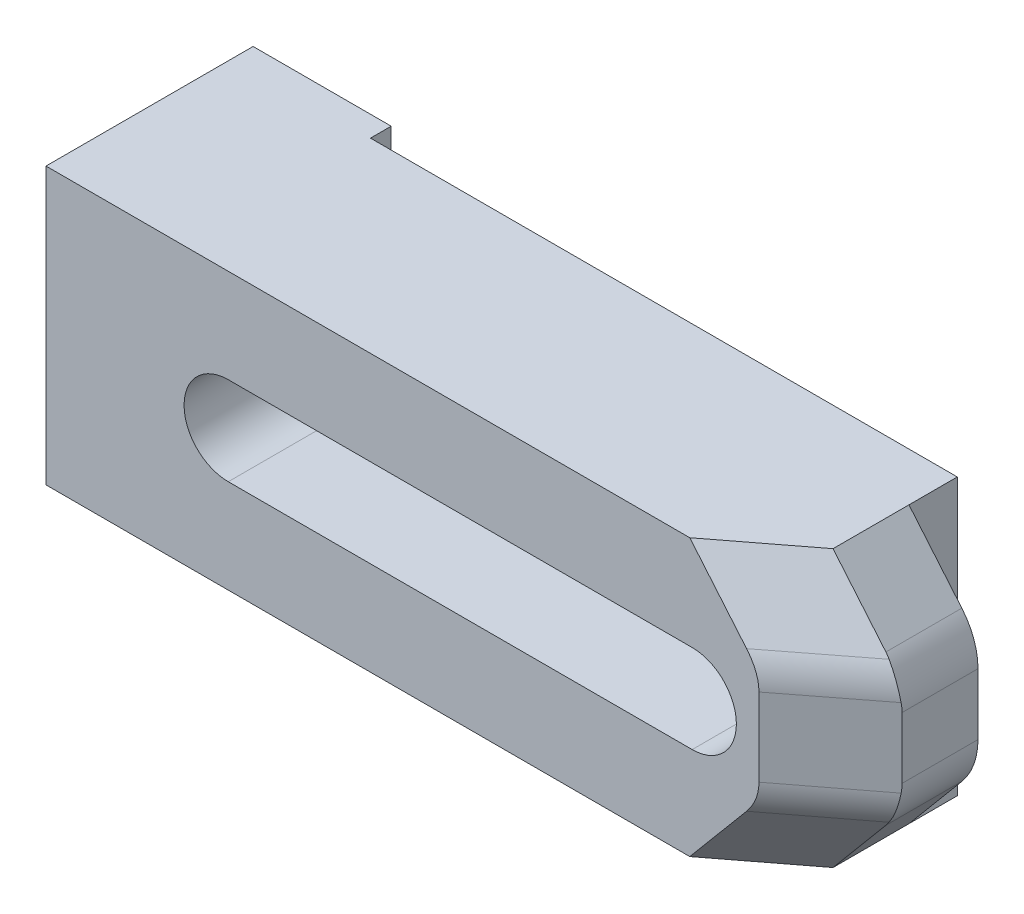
ISO-10303-21;
HEADER;
FILE_DESCRIPTION(('STEP AP214'),'2;1');
FILE_NAME('part.step','',(''),(''),'','','');
FILE_SCHEMA(('AUTOMOTIVE_DESIGN { 1 0 10303 214 1 1 1 1 }'));
ENDSEC;
DATA;
#1=APPLICATION_CONTEXT('core data for automotive mechanical design processes');
#2=APPLICATION_PROTOCOL_DEFINITION('international standard','automotive_design',2000,#1);
#3=PRODUCT_CONTEXT('',#1,'mechanical');
#4=PRODUCT('Part','Part','',(#3));
#5=PRODUCT_RELATED_PRODUCT_CATEGORY('part','',(#4));
#6=PRODUCT_DEFINITION_FORMATION('','',#4);
#7=PRODUCT_DEFINITION_CONTEXT('part definition',#1,'design');
#8=PRODUCT_DEFINITION('design','',#6,#7);
#9=PRODUCT_DEFINITION_SHAPE('','',#8);
#10=(LENGTH_UNIT() NAMED_UNIT(*) SI_UNIT(.MILLI.,.METRE.));
#11=(NAMED_UNIT(*) PLANE_ANGLE_UNIT() SI_UNIT($,.RADIAN.));
#12=(NAMED_UNIT(*) SI_UNIT($,.STERADIAN.) SOLID_ANGLE_UNIT());
#13=UNCERTAINTY_MEASURE_WITH_UNIT(LENGTH_MEASURE(1.E-05),#10,'distance_accuracy_value','');
#14=(GEOMETRIC_REPRESENTATION_CONTEXT(3) GLOBAL_UNCERTAINTY_ASSIGNED_CONTEXT((#13)) GLOBAL_UNIT_ASSIGNED_CONTEXT((#10,
#11,#12)) REPRESENTATION_CONTEXT('',''));
#15=CARTESIAN_POINT('',(0.,0.,0.));
#16=DIRECTION('',(0.,0.,1.));
#17=DIRECTION('',(1.,0.,0.));
#18=AXIS2_PLACEMENT_3D('',#15,#16,#17);
#19=CARTESIAN_POINT('',(21.4,-8.0824640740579,21.));
#20=DIRECTION('',(0.541675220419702,-0.454519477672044,0.707106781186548));
#21=DIRECTION('',(-0.64278760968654,-0.766044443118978,0.));
#22=AXIS2_PLACEMENT_3D('',#19,#20,#21);
#23=PLANE('',#22);
#24=CARTESIAN_POINT('',(11.4,-4.44276173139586,31.));
#25=DIRECTION('',(0.541675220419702,-0.454519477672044,0.707106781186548));
#26=DIRECTION('',(-0.541675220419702,0.454519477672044,0.707106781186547));
#27=AXIS2_PLACEMENT_3D('',#24,#25,#26);
#28=ELLIPSE('',#27,14.1421356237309,10.);
#29=CARTESIAN_POINT('',(19.06044443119,-10.8706378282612,21.));
#30=VERTEX_POINT('',#29);
#31=CARTESIAN_POINT('',(19.561335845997,-10.2213945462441,21.0336204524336));
#32=VERTEX_POINT('',#31);
#33=EDGE_CURVE('E9',#30,#32,#28,.T.);
#34=ORIENTED_EDGE('',*,*,#33,.T.);
#35=DIRECTION('',(-0.793352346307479,0.00158296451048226,0.608760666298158));
#36=VECTOR('',#35,1.);
#37=CARTESIAN_POINT('',(20.732156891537,-10.2237306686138,20.135217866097));
#38=LINE('',#37,#36);
#39=CARTESIAN_POINT('',(7.876122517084,-10.198079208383,30.));
#40=VERTEX_POINT('',#39);
#41=EDGE_CURVE('E25',#32,#40,#38,.T.);
#42=ORIENTED_EDGE('',*,*,#41,.T.);
#43=DIRECTION('',(0.64278760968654,0.766044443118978,0.));
#44=VECTOR('',#43,1.);
#45=CARTESIAN_POINT('',(14.505600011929,-2.29737558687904,30.));
#46=LINE('',#45,#44);
#47=CARTESIAN_POINT('',(-0.348665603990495,-20.,30.));
#48=VERTEX_POINT('',#47);
#49=EDGE_CURVE('E222',#48,#40,#46,.T.);
#50=ORIENTED_EDGE('',*,*,#49,.F.);
#51=DIRECTION('',(-0.793844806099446,0.,0.608120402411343));
#52=VECTOR('',#51,1.);
#53=CARTESIAN_POINT('',(17.701895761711,-20.,16.1724677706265));
#54=LINE('',#53,#52);
#55=CARTESIAN_POINT('',(11.4,-20.,21.));
#56=VERTEX_POINT('',#55);
#57=EDGE_CURVE('E221',#56,#48,#54,.T.);
#58=ORIENTED_EDGE('',*,*,#57,.F.);
#59=DIRECTION('',(-0.64278760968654,-0.766044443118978,0.));
#60=VECTOR('',#59,1.);
#61=CARTESIAN_POINT('',(11.4,-20.,21.));
#62=LINE('',#61,#60);
#63=EDGE_CURVE('E207',#30,#56,#62,.T.);
#64=ORIENTED_EDGE('',*,*,#63,.F.);
#65=EDGE_LOOP('',(#34,#42,#50,#58,#64));
#66=FACE_BOUND('',#65,.T.);
#67=ADVANCED_FACE('F14',(#66),#23,.T.);
#68=CARTESIAN_POINT('',(11.4,20.,21.));
#69=DIRECTION('',(0.541675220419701,0.454519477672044,0.707106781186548));
#70=DIRECTION('',(0.64278760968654,-0.766044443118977,0.));
#71=AXIS2_PLACEMENT_3D('',#68,#69,#70);
#72=PLANE('',#71);
#73=DIRECTION('',(0.793352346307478,0.00158296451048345,-0.608760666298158));
#74=VECTOR('',#73,1.);
#75=CARTESIAN_POINT('',(14.453044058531,10.2112020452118,24.9533506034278));
#76=LINE('',#75,#74);
#77=CARTESIAN_POINT('',(7.876122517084,10.198079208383,30.));
#78=VERTEX_POINT('',#77);
#79=CARTESIAN_POINT('',(19.561335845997,10.2213945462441,21.0336204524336));
#80=VERTEX_POINT('',#79);
#81=EDGE_CURVE('E369',#78,#80,#76,.T.);
#82=ORIENTED_EDGE('',*,*,#81,.T.);
#83=CARTESIAN_POINT('',(11.4,4.44276173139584,31.));
#84=DIRECTION('',(0.541675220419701,0.454519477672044,0.707106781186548));
#85=DIRECTION('',(-0.541675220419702,-0.454519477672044,0.707106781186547));
#86=AXIS2_PLACEMENT_3D('',#83,#84,#85);
#87=ELLIPSE('',#86,14.1421356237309,10.);
#88=CARTESIAN_POINT('',(19.06044443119,10.8706378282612,21.));
#89=VERTEX_POINT('',#88);
#90=EDGE_CURVE('E310',#80,#89,#87,.T.);
#91=ORIENTED_EDGE('',*,*,#90,.T.);
#92=DIRECTION('',(0.64278760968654,-0.766044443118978,0.));
#93=VECTOR('',#92,1.);
#94=CARTESIAN_POINT('',(21.4,8.08246407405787,21.));
#95=LINE('',#94,#93);
#96=CARTESIAN_POINT('',(11.4,20.,21.));
#97=VERTEX_POINT('',#96);
#98=EDGE_CURVE('E218',#97,#89,#95,.T.);
#99=ORIENTED_EDGE('',*,*,#98,.F.);
#100=DIRECTION('',(0.793844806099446,0.,-0.608120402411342));
#101=VECTOR('',#100,1.);
#102=CARTESIAN_POINT('',(11.4,20.,21.));
#103=LINE('',#102,#101);
#104=CARTESIAN_POINT('',(-0.348665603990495,20.,30.));
#105=VERTEX_POINT('',#104);
#106=EDGE_CURVE('E306',#105,#97,#103,.T.);
#107=ORIENTED_EDGE('',*,*,#106,.F.);
#108=DIRECTION('',(-0.64278760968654,0.766044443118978,0.));
#109=VECTOR('',#108,1.);
#110=CARTESIAN_POINT('',(4.50560001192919,14.2149115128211,30.));
#111=LINE('',#110,#109);
#112=EDGE_CURVE('E291',#78,#105,#111,.T.);
#113=ORIENTED_EDGE('',*,*,#112,.F.);
#114=EDGE_LOOP('',(#82,#91,#99,#107,#113));
#115=FACE_BOUND('',#114,.T.);
#116=ADVANCED_FACE('F345',(#115),#72,.T.);
#117=CARTESIAN_POINT('',(21.4,20.,30.));
#118=DIRECTION('',(0.,-1.,0.));
#119=DIRECTION('',(-1.,0.,0.));
#120=AXIS2_PLACEMENT_3D('',#117,#118,#119);
#121=PLANE('',#120);
#122=DIRECTION('',(-1.,0.,0.));
#123=VECTOR('',#122,1.);
#124=CARTESIAN_POINT('',(21.4,20.,30.));
#125=LINE('',#124,#123);
#126=CARTESIAN_POINT('',(-93.6,20.,30.));
#127=VERTEX_POINT('',#126);
#128=EDGE_CURVE('E516',#105,#127,#125,.T.);
#129=ORIENTED_EDGE('',*,*,#128,.F.);
#130=ORIENTED_EDGE('',*,*,#106,.T.);
#131=DIRECTION('',(0.,0.,1.));
#132=VECTOR('',#131,1.);
#133=CARTESIAN_POINT('',(11.4,20.,-3.));
#134=LINE('',#133,#132);
#135=CARTESIAN_POINT('',(11.4,20.,10.));
#136=VERTEX_POINT('',#135);
#137=EDGE_CURVE('E261',#136,#97,#134,.T.);
#138=ORIENTED_EDGE('',*,*,#137,.F.);
#139=DIRECTION('',(0.,0.,1.));
#140=VECTOR('',#139,1.);
#141=CARTESIAN_POINT('',(11.4,20.,30.));
#142=LINE('',#141,#140);
#143=CARTESIAN_POINT('',(11.4,20.,3.));
#144=VERTEX_POINT('',#143);
#145=EDGE_CURVE('E520',#144,#136,#142,.T.);
#146=ORIENTED_EDGE('',*,*,#145,.F.);
#147=DIRECTION('',(1.,0.,0.));
#148=VECTOR('',#147,1.);
#149=CARTESIAN_POINT('',(21.4,20.,3.));
#150=LINE('',#149,#148);
#151=CARTESIAN_POINT('',(-73.6,20.,3.));
#152=VERTEX_POINT('',#151);
#153=EDGE_CURVE('E300',#152,#144,#150,.T.);
#154=ORIENTED_EDGE('',*,*,#153,.F.);
#155=DIRECTION('',(0.,0.,1.));
#156=VECTOR('',#155,1.);
#157=CARTESIAN_POINT('',(-73.6,20.,30.));
#158=LINE('',#157,#156);
#159=CARTESIAN_POINT('',(-73.6,20.,0.));
#160=VERTEX_POINT('',#159);
#161=EDGE_CURVE('E270',#160,#152,#158,.T.);
#162=ORIENTED_EDGE('',*,*,#161,.F.);
#163=DIRECTION('',(-1.,0.,0.));
#164=VECTOR('',#163,1.);
#165=CARTESIAN_POINT('',(21.4,20.,0.));
#166=LINE('',#165,#164);
#167=CARTESIAN_POINT('',(-93.6,20.,0.));
#168=VERTEX_POINT('',#167);
#169=EDGE_CURVE('E305',#160,#168,#166,.T.);
#170=ORIENTED_EDGE('',*,*,#169,.T.);
#171=DIRECTION('',(0.,0.,-1.));
#172=VECTOR('',#171,1.);
#173=CARTESIAN_POINT('',(-93.6,20.,30.));
#174=LINE('',#173,#172);
#175=EDGE_CURVE('E314',#127,#168,#174,.T.);
#176=ORIENTED_EDGE('',*,*,#175,.F.);
#177=EDGE_LOOP('',(#129,#130,#138,#146,#154,#162,#170,#176));
#178=FACE_BOUND('',#177,.T.);
#179=ADVANCED_FACE('F341',(#178),#121,.F.);
#180=CARTESIAN_POINT('',(21.4,-20.,30.));
#181=DIRECTION('',(-1.,0.,0.));
#182=DIRECTION('',(0.,-1.,0.));
#183=AXIS2_PLACEMENT_3D('',#180,#181,#182);
#184=PLANE('',#183);
#185=DIRECTION('',(0.,-1.,0.));
#186=VECTOR('',#185,1.);
#187=CARTESIAN_POINT('',(21.4,30.,10.));
#188=LINE('',#187,#186);
#189=CARTESIAN_POINT('',(21.4,4.44276173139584,10.));
#190=VERTEX_POINT('',#189);
#191=CARTESIAN_POINT('',(21.4,-4.44276173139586,10.));
#192=VERTEX_POINT('',#191);
#193=EDGE_CURVE('E244',#190,#192,#188,.T.);
#194=ORIENTED_EDGE('',*,*,#193,.F.);
#195=DIRECTION('',(0.,0.,1.));
#196=VECTOR('',#195,1.);
#197=CARTESIAN_POINT('',(21.4,4.44276173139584,30.));
#198=LINE('',#197,#196);
#199=CARTESIAN_POINT('',(21.4,4.44276173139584,21.));
#200=VERTEX_POINT('',#199);
#201=EDGE_CURVE('E301',#190,#200,#198,.T.);
#202=ORIENTED_EDGE('',*,*,#201,.T.);
#203=DIRECTION('',(0.,-1.,0.));
#204=VECTOR('',#203,1.);
#205=CARTESIAN_POINT('',(21.4,30.,21.));
#206=LINE('',#205,#204);
#207=CARTESIAN_POINT('',(21.4,-4.44276173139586,21.));
#208=VERTEX_POINT('',#207);
#209=EDGE_CURVE('E240',#200,#208,#206,.T.);
#210=ORIENTED_EDGE('',*,*,#209,.T.);
#211=DIRECTION('',(0.,0.,-1.));
#212=VECTOR('',#211,1.);
#213=CARTESIAN_POINT('',(21.4,-4.44276173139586,30.));
#214=LINE('',#213,#212);
#215=EDGE_CURVE('E233',#208,#192,#214,.T.);
#216=ORIENTED_EDGE('',*,*,#215,.T.);
#217=EDGE_LOOP('',(#194,#202,#210,#216));
#218=FACE_BOUND('',#217,.T.);
#219=ADVANCED_FACE('F638',(#218),#184,.F.);
#220=CARTESIAN_POINT('',(-93.6,-20.,30.));
#221=DIRECTION('',(0.,1.,0.));
#222=DIRECTION('',(1.,0.,0.));
#223=AXIS2_PLACEMENT_3D('',#220,#221,#222);
#224=PLANE('',#223);
#225=DIRECTION('',(0.,0.,1.));
#226=VECTOR('',#225,1.);
#227=CARTESIAN_POINT('',(11.4,-20.,-3.));
#228=LINE('',#227,#226);
#229=CARTESIAN_POINT('',(11.4,-20.,10.));
#230=VERTEX_POINT('',#229);
#231=EDGE_CURVE('E211',#230,#56,#228,.T.);
#232=ORIENTED_EDGE('',*,*,#231,.T.);
#233=ORIENTED_EDGE('',*,*,#57,.T.);
#234=DIRECTION('',(1.,0.,0.));
#235=VECTOR('',#234,1.);
#236=CARTESIAN_POINT('',(-93.6,-20.,30.));
#237=LINE('',#236,#235);
#238=CARTESIAN_POINT('',(-93.6,-20.,30.));
#239=VERTEX_POINT('',#238);
#240=EDGE_CURVE('E501',#239,#48,#237,.T.);
#241=ORIENTED_EDGE('',*,*,#240,.F.);
#242=DIRECTION('',(0.,0.,-1.));
#243=VECTOR('',#242,1.);
#244=CARTESIAN_POINT('',(-93.6,-20.,30.));
#245=LINE('',#244,#243);
#246=CARTESIAN_POINT('',(-93.6,-20.,0.));
#247=VERTEX_POINT('',#246);
#248=EDGE_CURVE('E226',#239,#247,#245,.T.);
#249=ORIENTED_EDGE('',*,*,#248,.T.);
#250=DIRECTION('',(1.,0.,0.));
#251=VECTOR('',#250,1.);
#252=CARTESIAN_POINT('',(-93.6,-20.,0.));
#253=LINE('',#252,#251);
#254=CARTESIAN_POINT('',(-73.6,-20.,0.));
#255=VERTEX_POINT('',#254);
#256=EDGE_CURVE('E253',#247,#255,#253,.T.);
#257=ORIENTED_EDGE('',*,*,#256,.T.);
#258=DIRECTION('',(0.,0.,-1.));
#259=VECTOR('',#258,1.);
#260=CARTESIAN_POINT('',(-73.6,-20.,30.));
#261=LINE('',#260,#259);
#262=CARTESIAN_POINT('',(-73.6,-20.,3.));
#263=VERTEX_POINT('',#262);
#264=EDGE_CURVE('E473',#263,#255,#261,.T.);
#265=ORIENTED_EDGE('',*,*,#264,.F.);
#266=DIRECTION('',(-1.,0.,0.));
#267=VECTOR('',#266,1.);
#268=CARTESIAN_POINT('',(-93.6,-20.,3.));
#269=LINE('',#268,#267);
#270=CARTESIAN_POINT('',(11.4,-20.,3.));
#271=VERTEX_POINT('',#270);
#272=EDGE_CURVE('E297',#271,#263,#269,.T.);
#273=ORIENTED_EDGE('',*,*,#272,.F.);
#274=DIRECTION('',(0.,0.,-1.));
#275=VECTOR('',#274,1.);
#276=CARTESIAN_POINT('',(11.4,-20.,30.));
#277=LINE('',#276,#275);
#278=EDGE_CURVE('E231',#230,#271,#277,.T.);
#279=ORIENTED_EDGE('',*,*,#278,.F.);
#280=EDGE_LOOP('',(#232,#233,#241,#249,#257,#265,#273,#279));
#281=FACE_BOUND('',#280,.T.);
#282=ADVANCED_FACE('F229',(#281),#224,.F.);
#283=CARTESIAN_POINT('',(-93.6,20.,30.));
#284=DIRECTION('',(1.,0.,0.));
#285=DIRECTION('',(0.,0.,1.));
#286=AXIS2_PLACEMENT_3D('',#283,#284,#285);
#287=PLANE('',#286);
#288=DIRECTION('',(0.,-1.,0.));
#289=VECTOR('',#288,1.);
#290=CARTESIAN_POINT('',(-93.6,20.,0.));
#291=LINE('',#290,#289);
#292=EDGE_CURVE('E257',#168,#247,#291,.T.);
#293=ORIENTED_EDGE('',*,*,#292,.T.);
#294=ORIENTED_EDGE('',*,*,#248,.F.);
#295=DIRECTION('',(0.,-1.,0.));
#296=VECTOR('',#295,1.);
#297=CARTESIAN_POINT('',(-93.6,20.,30.));
#298=LINE('',#297,#296);
#299=EDGE_CURVE('E504',#127,#239,#298,.T.);
#300=ORIENTED_EDGE('',*,*,#299,.F.);
#301=ORIENTED_EDGE('',*,*,#175,.T.);
#302=EDGE_LOOP('',(#293,#294,#300,#301));
#303=FACE_BOUND('',#302,.T.);
#304=ADVANCED_FACE('F419',(#303),#287,.F.);
#305=CARTESIAN_POINT('',(-93.6,0.,30.));
#306=DIRECTION('',(0.,0.,1.));
#307=DIRECTION('',(-1.,0.,0.));
#308=AXIS2_PLACEMENT_3D('',#305,#306,#307);
#309=PLANE('',#308);
#310=CARTESIAN_POINT('',(-67.2,0.,30.));
#311=DIRECTION('',(0.,0.,-1.));
#312=DIRECTION('',(-1.,0.,0.));
#313=AXIS2_PLACEMENT_3D('',#310,#311,#312);
#314=CIRCLE('',#313,6.4);
#315=CARTESIAN_POINT('',(-67.2,-6.4,30.));
#316=VERTEX_POINT('',#315);
#317=CARTESIAN_POINT('',(-67.2,6.4,30.));
#318=VERTEX_POINT('',#317);
#319=EDGE_CURVE('E519',#316,#318,#314,.T.);
#320=ORIENTED_EDGE('',*,*,#319,.T.);
#321=DIRECTION('',(1.,0.,0.));
#322=VECTOR('',#321,1.);
#323=CARTESIAN_POINT('',(-67.2,6.4,30.));
#324=LINE('',#323,#322);
#325=CARTESIAN_POINT('',(0.,6.4,30.));
#326=VERTEX_POINT('',#325);
#327=EDGE_CURVE('E467',#318,#326,#324,.T.);
#328=ORIENTED_EDGE('',*,*,#327,.T.);
#329=CARTESIAN_POINT('',(0.,0.,30.));
#330=DIRECTION('',(0.,0.,-1.));
#331=DIRECTION('',(-1.,0.,0.));
#332=AXIS2_PLACEMENT_3D('',#329,#330,#331);
#333=CIRCLE('',#332,6.4);
#334=CARTESIAN_POINT('',(0.,-6.4,30.));
#335=VERTEX_POINT('',#334);
#336=EDGE_CURVE('E480',#326,#335,#333,.T.);
#337=ORIENTED_EDGE('',*,*,#336,.T.);
#338=DIRECTION('',(-1.,0.,0.));
#339=VECTOR('',#338,1.);
#340=CARTESIAN_POINT('',(0.,-6.4,30.));
#341=LINE('',#340,#339);
#342=EDGE_CURVE('E290',#335,#316,#341,.T.);
#343=ORIENTED_EDGE('',*,*,#342,.T.);
#344=EDGE_LOOP('',(#320,#328,#337,#343));
#345=FACE_BOUND('',#344,.T.);
#346=DIRECTION('',(0.,-1.,0.));
#347=VECTOR('',#346,1.);
#348=CARTESIAN_POINT('',(9.670971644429,30.,30.));
#349=LINE('',#348,#347);
#350=CARTESIAN_POINT('',(9.670971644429,5.65512710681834,30.));
#351=VERTEX_POINT('',#350);
#352=CARTESIAN_POINT('',(9.670971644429,-5.65512710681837,30.));
#353=VERTEX_POINT('',#352);
#354=EDGE_CURVE('E381',#351,#353,#349,.T.);
#355=ORIENTED_EDGE('',*,*,#354,.F.);
#356=CARTESIAN_POINT('',(-6.7558246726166,5.63449748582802,30.));
#357=DIRECTION('',(0.,0.,1.));
#358=DIRECTION('',(0.999998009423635,0.00199528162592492,0.));
#359=AXIS2_PLACEMENT_3D('',#356,#357,#358);
#360=ELLIPSE('',#359,16.4268168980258,10.);
#361=EDGE_CURVE('E286',#351,#78,#360,.T.);
#362=ORIENTED_EDGE('',*,*,#361,.T.);
#363=ORIENTED_EDGE('',*,*,#112,.T.);
#364=ORIENTED_EDGE('',*,*,#128,.T.);
#365=ORIENTED_EDGE('',*,*,#299,.T.);
#366=ORIENTED_EDGE('',*,*,#240,.T.);
#367=ORIENTED_EDGE('',*,*,#49,.T.);
#368=CARTESIAN_POINT('',(-6.7558246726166,-5.63449748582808,30.));
#369=DIRECTION('',(0.,0.,1.));
#370=DIRECTION('',(-0.999998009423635,0.00199528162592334,0.));
#371=AXIS2_PLACEMENT_3D('',#368,#369,#370);
#372=ELLIPSE('',#371,16.4268168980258,10.);
#373=EDGE_CURVE('E472',#40,#353,#372,.T.);
#374=ORIENTED_EDGE('',*,*,#373,.T.);
#375=EDGE_LOOP('',(#355,#362,#363,#364,#365,#366,#367,#374));
#376=FACE_BOUND('',#375,.T.);
#377=ADVANCED_FACE('F16',(#345,#376),#309,.T.);
#378=CARTESIAN_POINT('',(-93.6,0.,0.));
#379=DIRECTION('',(0.,0.,1.));
#380=DIRECTION('',(-1.,0.,0.));
#381=AXIS2_PLACEMENT_3D('',#378,#379,#380);
#382=PLANE('',#381);
#383=ORIENTED_EDGE('',*,*,#169,.F.);
#384=DIRECTION('',(0.,-1.,0.));
#385=VECTOR('',#384,1.);
#386=CARTESIAN_POINT('',(-73.6,30.,0.));
#387=LINE('',#386,#385);
#388=EDGE_CURVE('E469',#160,#255,#387,.T.);
#389=ORIENTED_EDGE('',*,*,#388,.T.);
#390=ORIENTED_EDGE('',*,*,#256,.F.);
#391=ORIENTED_EDGE('',*,*,#292,.F.);
#392=EDGE_LOOP('',(#383,#389,#390,#391));
#393=FACE_BOUND('',#392,.T.);
#394=ADVANCED_FACE('F413',(#393),#382,.F.);
#395=CARTESIAN_POINT('',(-73.6,30.,0.));
#396=DIRECTION('',(1.,0.,0.));
#397=DIRECTION('',(0.,0.,1.));
#398=AXIS2_PLACEMENT_3D('',#395,#396,#397);
#399=PLANE('',#398);
#400=ORIENTED_EDGE('',*,*,#264,.T.);
#401=ORIENTED_EDGE('',*,*,#388,.F.);
#402=ORIENTED_EDGE('',*,*,#161,.T.);
#403=DIRECTION('',(0.,1.,0.));
#404=VECTOR('',#403,1.);
#405=CARTESIAN_POINT('',(-73.6,30.,3.));
#406=LINE('',#405,#404);
#407=CARTESIAN_POINT('',(-73.6,0.,3.));
#408=VERTEX_POINT('',#407);
#409=EDGE_CURVE('E296',#408,#152,#406,.T.);
#410=ORIENTED_EDGE('',*,*,#409,.F.);
#411=DIRECTION('',(0.,1.,0.));
#412=VECTOR('',#411,1.);
#413=CARTESIAN_POINT('',(-73.6,30.,3.));
#414=LINE('',#413,#412);
#415=EDGE_CURVE('E100',#263,#408,#414,.T.);
#416=ORIENTED_EDGE('',*,*,#415,.F.);
#417=EDGE_LOOP('',(#400,#401,#402,#410,#416));
#418=FACE_BOUND('',#417,.T.);
#419=ADVANCED_FACE('F409',(#418),#399,.T.);
#420=CARTESIAN_POINT('',(-73.6,30.,3.));
#421=DIRECTION('',(0.,0.,-1.));
#422=DIRECTION('',(0.,1.,0.));
#423=AXIS2_PLACEMENT_3D('',#420,#421,#422);
#424=PLANE('',#423);
#425=CARTESIAN_POINT('',(0.,0.,3.));
#426=DIRECTION('',(0.,0.,1.));
#427=DIRECTION('',(1.,0.,0.));
#428=AXIS2_PLACEMENT_3D('',#425,#426,#427);
#429=CIRCLE('',#428,6.4);
#430=CARTESIAN_POINT('',(0.,-6.4,3.));
#431=VERTEX_POINT('',#430);
#432=CARTESIAN_POINT('',(0.,6.4,3.));
#433=VERTEX_POINT('',#432);
#434=EDGE_CURVE('E267',#431,#433,#429,.T.);
#435=ORIENTED_EDGE('',*,*,#434,.T.);
#436=DIRECTION('',(-1.,0.,0.));
#437=VECTOR('',#436,1.);
#438=CARTESIAN_POINT('',(-73.6,6.4,3.));
#439=LINE('',#438,#437);
#440=CARTESIAN_POINT('',(-67.2,6.4,3.));
#441=VERTEX_POINT('',#440);
#442=EDGE_CURVE('E87',#433,#441,#439,.T.);
#443=ORIENTED_EDGE('',*,*,#442,.T.);
#444=CARTESIAN_POINT('',(-67.2,0.,3.));
#445=DIRECTION('',(0.,0.,1.));
#446=DIRECTION('',(1.,0.,0.));
#447=AXIS2_PLACEMENT_3D('',#444,#445,#446);
#448=CIRCLE('',#447,6.4);
#449=EDGE_CURVE('E292',#441,#408,#448,.T.);
#450=ORIENTED_EDGE('',*,*,#449,.T.);
#451=ORIENTED_EDGE('',*,*,#409,.T.);
#452=ORIENTED_EDGE('',*,*,#153,.T.);
#453=DIRECTION('',(0.,1.,0.));
#454=VECTOR('',#453,1.);
#455=CARTESIAN_POINT('',(11.4,30.,3.));
#456=LINE('',#455,#454);
#457=EDGE_CURVE('E497',#271,#144,#456,.T.);
#458=ORIENTED_EDGE('',*,*,#457,.F.);
#459=ORIENTED_EDGE('',*,*,#272,.T.);
#460=ORIENTED_EDGE('',*,*,#415,.T.);
#461=CARTESIAN_POINT('',(-67.2,0.,3.));
#462=DIRECTION('',(0.,0.,1.));
#463=DIRECTION('',(1.,0.,0.));
#464=AXIS2_PLACEMENT_3D('',#461,#462,#463);
#465=CIRCLE('',#464,6.4);
#466=CARTESIAN_POINT('',(-67.2,-6.4,3.));
#467=VERTEX_POINT('',#466);
#468=EDGE_CURVE('E476',#408,#467,#465,.T.);
#469=ORIENTED_EDGE('',*,*,#468,.T.);
#470=DIRECTION('',(1.,0.,0.));
#471=VECTOR('',#470,1.);
#472=CARTESIAN_POINT('',(-73.6,-6.4,3.));
#473=LINE('',#472,#471);
#474=EDGE_CURVE('E479',#467,#431,#473,.T.);
#475=ORIENTED_EDGE('',*,*,#474,.T.);
#476=EDGE_LOOP('',(#435,#443,#450,#451,#452,#458,#459,#460,#469,#475));
#477=FACE_BOUND('',#476,.T.);
#478=ADVANCED_FACE('F412',(#477),#424,.T.);
#479=CARTESIAN_POINT('',(11.4,30.,3.));
#480=DIRECTION('',(1.,0.,0.));
#481=DIRECTION('',(0.,0.,1.));
#482=AXIS2_PLACEMENT_3D('',#479,#480,#481);
#483=PLANE('',#482);
#484=ORIENTED_EDGE('',*,*,#145,.T.);
#485=DIRECTION('',(0.,1.,0.));
#486=VECTOR('',#485,1.);
#487=CARTESIAN_POINT('',(11.4,30.,10.));
#488=LINE('',#487,#486);
#489=EDGE_CURVE('E249',#230,#136,#488,.T.);
#490=ORIENTED_EDGE('',*,*,#489,.F.);
#491=ORIENTED_EDGE('',*,*,#278,.T.);
#492=ORIENTED_EDGE('',*,*,#457,.T.);
#493=EDGE_LOOP('',(#484,#490,#491,#492));
#494=FACE_BOUND('',#493,.T.);
#495=ADVANCED_FACE('F356',(#494),#483,.T.);
#496=CARTESIAN_POINT('',(11.4,30.,10.));
#497=DIRECTION('',(0.,0.,-1.));
#498=DIRECTION('',(0.,1.,0.));
#499=AXIS2_PLACEMENT_3D('',#496,#497,#498);
#500=PLANE('',#499);
#501=DIRECTION('',(-0.64278760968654,0.766044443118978,0.));
#502=VECTOR('',#501,1.);
#503=CARTESIAN_POINT('',(6.47596123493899,25.8682408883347,10.));
#504=LINE('',#503,#502);
#505=CARTESIAN_POINT('',(19.06044443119,10.8706378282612,10.));
#506=VERTEX_POINT('',#505);
#507=EDGE_CURVE('E265',#506,#136,#504,.T.);
#508=ORIENTED_EDGE('',*,*,#507,.F.);
#509=CARTESIAN_POINT('',(11.4,4.44276173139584,10.));
#510=DIRECTION('',(0.,0.,-1.));
#511=DIRECTION('',(1.,0.,0.));
#512=AXIS2_PLACEMENT_3D('',#509,#510,#511);
#513=CIRCLE('',#512,10.);
#514=EDGE_CURVE('E493',#506,#190,#513,.T.);
#515=ORIENTED_EDGE('',*,*,#514,.T.);
#516=ORIENTED_EDGE('',*,*,#193,.T.);
#517=CARTESIAN_POINT('',(11.4,-4.44276173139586,10.));
#518=DIRECTION('',(0.,0.,-1.));
#519=DIRECTION('',(1.,0.,0.));
#520=AXIS2_PLACEMENT_3D('',#517,#518,#519);
#521=CIRCLE('',#520,10.);
#522=CARTESIAN_POINT('',(19.06044443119,-10.8706378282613,10.));
#523=VERTEX_POINT('',#522);
#524=EDGE_CURVE('E246',#192,#523,#521,.T.);
#525=ORIENTED_EDGE('',*,*,#524,.T.);
#526=DIRECTION('',(0.64278760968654,0.766044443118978,0.));
#527=VECTOR('',#526,1.);
#528=CARTESIAN_POINT('',(36.020193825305,9.34120444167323,10.));
#529=LINE('',#528,#527);
#530=EDGE_CURVE('E274',#230,#523,#529,.T.);
#531=ORIENTED_EDGE('',*,*,#530,.F.);
#532=ORIENTED_EDGE('',*,*,#489,.T.);
#533=EDGE_LOOP('',(#508,#515,#516,#525,#531,#532));
#534=FACE_BOUND('',#533,.T.);
#535=ADVANCED_FACE('F415',(#534),#500,.T.);
#536=CARTESIAN_POINT('',(21.4,-8.0824640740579,-3.));
#537=DIRECTION('',(-0.766044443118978,0.642787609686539,0.));
#538=DIRECTION('',(0.,0.,-1.));
#539=AXIS2_PLACEMENT_3D('',#536,#537,#538);
#540=PLANE('',#539);
#541=ORIENTED_EDGE('',*,*,#530,.T.);
#542=DIRECTION('',(0.,0.,1.));
#543=VECTOR('',#542,1.);
#544=CARTESIAN_POINT('',(19.06044443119,-10.8706378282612,-3.));
#545=LINE('',#544,#543);
#546=EDGE_CURVE('E214',#523,#30,#545,.T.);
#547=ORIENTED_EDGE('',*,*,#546,.T.);
#548=ORIENTED_EDGE('',*,*,#63,.T.);
#549=ORIENTED_EDGE('',*,*,#231,.F.);
#550=EDGE_LOOP('',(#541,#547,#548,#549));
#551=FACE_BOUND('',#550,.T.);
#552=ADVANCED_FACE('F209',(#551),#540,.F.);
#553=CARTESIAN_POINT('',(11.4,20.,-3.));
#554=DIRECTION('',(-0.766044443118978,-0.642787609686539,0.));
#555=DIRECTION('',(0.,0.,-1.));
#556=AXIS2_PLACEMENT_3D('',#553,#554,#555);
#557=PLANE('',#556);
#558=ORIENTED_EDGE('',*,*,#98,.T.);
#559=DIRECTION('',(0.,0.,-1.));
#560=VECTOR('',#559,1.);
#561=CARTESIAN_POINT('',(19.06044443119,10.8706378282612,-3.));
#562=LINE('',#561,#560);
#563=EDGE_CURVE('E260',#89,#506,#562,.T.);
#564=ORIENTED_EDGE('',*,*,#563,.T.);
#565=ORIENTED_EDGE('',*,*,#507,.T.);
#566=ORIENTED_EDGE('',*,*,#137,.T.);
#567=EDGE_LOOP('',(#558,#564,#565,#566));
#568=FACE_BOUND('',#567,.T.);
#569=ADVANCED_FACE('F423',(#568),#557,.F.);
#570=CARTESIAN_POINT('',(21.4,30.,21.));
#571=DIRECTION('',(0.60876142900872,0.,0.793353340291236));
#572=DIRECTION('',(0.,-1.,0.));
#573=AXIS2_PLACEMENT_3D('',#570,#571,#572);
#574=PLANE('',#573);
#575=ORIENTED_EDGE('',*,*,#209,.F.);
#576=CARTESIAN_POINT('',(11.4,4.44276173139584,28.6732698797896));
#577=DIRECTION('',(0.60876142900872,0.,0.793353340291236));
#578=DIRECTION('',(-0.793353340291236,0.,0.60876142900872));
#579=AXIS2_PLACEMENT_3D('',#576,#577,#578);
#580=ELLIPSE('',#579,12.6047241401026,10.);
#581=CARTESIAN_POINT('',(21.323369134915,5.67837696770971,21.0588009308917));
#582=VERTEX_POINT('',#581);
#583=EDGE_CURVE('E266',#200,#582,#580,.T.);
#584=ORIENTED_EDGE('',*,*,#583,.T.);
#585=DIRECTION('',(-0.793352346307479,-0.00158296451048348,0.608760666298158));
#586=VECTOR('',#585,1.);
#587=CARTESIAN_POINT('',(21.430544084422,5.67859081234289,20.9765626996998));
#588=LINE('',#587,#586);
#589=EDGE_CURVE('E377',#582,#351,#588,.T.);
#590=ORIENTED_EDGE('',*,*,#589,.T.);
#591=ORIENTED_EDGE('',*,*,#354,.T.);
#592=DIRECTION('',(0.793352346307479,-0.00158296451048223,-0.608760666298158));
#593=VECTOR('',#592,1.);
#594=CARTESIAN_POINT('',(21.355193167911,-5.67844046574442,21.0343814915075));
#595=LINE('',#594,#593);
#596=CARTESIAN_POINT('',(21.323369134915,-5.67837696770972,21.0588009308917));
#597=VERTEX_POINT('',#596);
#598=EDGE_CURVE('E452',#353,#597,#595,.T.);
#599=ORIENTED_EDGE('',*,*,#598,.T.);
#600=CARTESIAN_POINT('',(11.4,-4.44276173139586,28.6732698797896));
#601=DIRECTION('',(0.60876142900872,0.,0.793353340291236));
#602=DIRECTION('',(-0.793353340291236,0.,0.60876142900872));
#603=AXIS2_PLACEMENT_3D('',#600,#601,#602);
#604=ELLIPSE('',#603,12.6047241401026,10.);
#605=EDGE_CURVE('E448',#597,#208,#604,.T.);
#606=ORIENTED_EDGE('',*,*,#605,.T.);
#607=EDGE_LOOP('',(#575,#584,#590,#591,#599,#606));
#608=FACE_BOUND('',#607,.T.);
#609=ADVANCED_FACE('F354',(#608),#574,.T.);
#610=CARTESIAN_POINT('',(9.03629185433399,5.66600726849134,17.8822827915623));
#611=DIRECTION('',(0.793352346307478,0.00158296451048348,-0.608760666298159));
#612=DIRECTION('',(0.608761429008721,0.,0.793353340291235));
#613=AXIS2_PLACEMENT_3D('',#610,#611,#612);
#614=CYLINDRICAL_SURFACE('',#613,10.);
#615=ORIENTED_EDGE('',*,*,#361,.F.);
#616=ORIENTED_EDGE('',*,*,#589,.F.);
#617=CARTESIAN_POINT('',(19.5613358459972,10.2213945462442,21.0336204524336));
#618=CARTESIAN_POINT('',(19.6250808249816,10.1313669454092,21.0426573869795));
#619=CARTESIAN_POINT('',(19.6873542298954,10.0402564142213,21.051291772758));
#620=CARTESIAN_POINT('',(19.8076269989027,9.85787832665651,21.0675287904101));
#621=CARTESIAN_POINT('',(19.8656881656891,9.76665309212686,21.0751490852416));
#622=CARTESIAN_POINT('',(19.9776573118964,9.58425999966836,21.0893584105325));
#623=CARTESIAN_POINT('',(20.0316270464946,9.49313148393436,21.0959657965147));
#624=CARTESIAN_POINT('',(20.1355415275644,9.31113488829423,21.108148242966));
#625=CARTESIAN_POINT('',(20.1855478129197,9.22030322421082,21.1137424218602));
#626=CARTESIAN_POINT('',(20.2816690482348,9.03909102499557,21.123897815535));
#627=CARTESIAN_POINT('',(20.327845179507,8.94874405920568,21.128478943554));
#628=CARTESIAN_POINT('',(20.4164445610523,8.76868015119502,21.136607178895));
#629=CARTESIAN_POINT('',(20.4589284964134,8.67899400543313,21.1401750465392));
#630=CARTESIAN_POINT('',(20.540285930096,8.5004187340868,21.1462766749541));
#631=CARTESIAN_POINT('',(20.5792194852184,8.41155771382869,21.1488320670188));
#632=CARTESIAN_POINT('',(20.6536215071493,8.23478902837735,21.1529050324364));
#633=CARTESIAN_POINT('',(20.689149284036,8.14690683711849,21.1544452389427));
#634=CARTESIAN_POINT('',(20.7621226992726,7.95874149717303,21.1566554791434));
#635=CARTESIAN_POINT('',(20.7992233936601,7.85832267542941,21.1571874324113));
#636=CARTESIAN_POINT('',(20.8697548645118,7.65755983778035,21.156936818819));
#637=CARTESIAN_POINT('',(20.9032243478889,7.55722939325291,21.156169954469));
#638=CARTESIAN_POINT('',(20.9665766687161,7.35678399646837,21.1533184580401));
#639=CARTESIAN_POINT('',(20.996497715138,7.25668089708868,21.1512497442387));
#640=CARTESIAN_POINT('',(21.0528401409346,7.05682503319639,21.1457951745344));
#641=CARTESIAN_POINT('',(21.0792991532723,6.95708243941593,21.1424253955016));
#642=CARTESIAN_POINT('',(21.12880827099,6.75807535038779,21.1343683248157));
#643=CARTESIAN_POINT('',(21.1518953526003,6.65881939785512,21.1296972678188));
#644=CARTESIAN_POINT('',(21.1947547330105,6.46090669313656,21.1190375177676));
#645=CARTESIAN_POINT('',(21.2145632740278,6.36225690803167,21.1130651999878));
#646=CARTESIAN_POINT('',(21.2509622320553,6.16567071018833,21.0998028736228));
#647=CARTESIAN_POINT('',(21.2675880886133,6.06773974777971,21.0925293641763));
#648=CARTESIAN_POINT('',(21.2977222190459,5.87269937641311,21.0766641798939));
#649=CARTESIAN_POINT('',(21.311265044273,5.77559395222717,21.0680891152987));
#650=CARTESIAN_POINT('',(21.3233691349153,5.67837696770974,21.0588009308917));
#651=B_SPLINE_CURVE_WITH_KNOTS('',3,(#617,#618,#619,#620,#621,#622,#623,#624,#625,#626,#627,
#628,#629,#630,#631,#632,#633,#634,#635,#636,#637,#638,#639,#640,#641,#642,#643,#644,#645,#646,
#647,#648,#649,#650),.UNSPECIFIED.,.F.,.F.,(4,2,2,2,2,2,2,2,2,2,2,2,2,2,2,2,4),(0.,
0.332024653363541,0.657173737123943,0.975467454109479,1.28692734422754,1.59157639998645,
1.88943919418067,2.18054202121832,2.46491305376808,2.78601226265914,3.10325707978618,
3.41669623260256,3.7263802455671,4.03236150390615,4.33469431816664,4.63343498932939,
4.92864187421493),.UNSPECIFIED.);
#652=EDGE_CURVE('E323',#80,#582,#651,.T.);
#653=ORIENTED_EDGE('',*,*,#652,.F.);
#654=ORIENTED_EDGE('',*,*,#81,.F.);
#655=EDGE_LOOP('',(#615,#616,#653,#654));
#656=FACE_BOUND('',#655,.T.);
#657=ADVANCED_FACE('F340',(#656),#614,.T.);
#658=CARTESIAN_POINT('',(11.4,4.44276173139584,30.));
#659=DIRECTION('',(0.,0.,1.));
#660=DIRECTION('',(-1.,0.,0.));
#661=AXIS2_PLACEMENT_3D('',#658,#659,#660);
#662=CYLINDRICAL_SURFACE('',#661,10.);
#663=ORIENTED_EDGE('',*,*,#514,.F.);
#664=ORIENTED_EDGE('',*,*,#563,.F.);
#665=ORIENTED_EDGE('',*,*,#90,.F.);
#666=ORIENTED_EDGE('',*,*,#652,.T.);
#667=ORIENTED_EDGE('',*,*,#583,.F.);
#668=ORIENTED_EDGE('',*,*,#201,.F.);
#669=EDGE_LOOP('',(#663,#664,#665,#666,#667,#668));
#670=FACE_BOUND('',#669,.T.);
#671=ADVANCED_FACE('F329',(#670),#662,.T.);
#672=CARTESIAN_POINT('',(11.4,-4.44276173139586,-3.));
#673=DIRECTION('',(0.,0.,1.));
#674=DIRECTION('',(-1.,0.,0.));
#675=AXIS2_PLACEMENT_3D('',#672,#673,#674);
#676=CYLINDRICAL_SURFACE('',#675,10.);
#677=ORIENTED_EDGE('',*,*,#215,.F.);
#678=ORIENTED_EDGE('',*,*,#605,.F.);
#679=CARTESIAN_POINT('',(19.561335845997,-10.2213945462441,21.0336204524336));
#680=CARTESIAN_POINT('',(19.6197515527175,-10.1388940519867,21.0419029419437));
#681=CARTESIAN_POINT('',(19.6769431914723,-10.0554945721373,21.049875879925));
#682=CARTESIAN_POINT('',(19.7888334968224,-9.88693692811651,21.0651369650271));
#683=CARTESIAN_POINT('',(19.8435312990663,-9.80177816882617,21.0724248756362));
#684=CARTESIAN_POINT('',(19.9503824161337,-9.62974401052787,21.0862487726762));
#685=CARTESIAN_POINT('',(20.0025341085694,-9.54286756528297,21.0927842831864));
#686=CARTESIAN_POINT('',(20.1042424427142,-9.36744525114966,21.1050366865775));
#687=CARTESIAN_POINT('',(20.1537966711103,-9.27889793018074,21.1107528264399));
#688=CARTESIAN_POINT('',(20.2502595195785,-9.10018444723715,21.1213000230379));
#689=CARTESIAN_POINT('',(20.2971649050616,-9.01001647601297,21.1261300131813));
#690=CARTESIAN_POINT('',(20.3882798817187,-8.82811619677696,21.1348388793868));
#691=CARTESIAN_POINT('',(20.4324853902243,-8.73638177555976,21.1387163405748));
#692=CARTESIAN_POINT('',(20.518150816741,-8.55140693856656,21.1454546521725));
#693=CARTESIAN_POINT('',(20.5596057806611,-8.45816416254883,21.1483137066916));
#694=CARTESIAN_POINT('',(20.639720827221,-8.27023487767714,21.1529503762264));
#695=CARTESIAN_POINT('',(20.6783750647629,-8.17554582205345,21.1547257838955));
#696=CARTESIAN_POINT('',(20.7528399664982,-7.98479018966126,21.1571311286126));
#697=CARTESIAN_POINT('',(20.7886438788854,-7.88872094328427,21.1577584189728));
#698=CARTESIAN_POINT('',(20.8573601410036,-7.69527512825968,21.1578044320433));
#699=CARTESIAN_POINT('',(20.890264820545,-7.59789583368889,21.157220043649));
#700=CARTESIAN_POINT('',(20.953135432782,-7.40190413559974,21.1547806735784));
#701=CARTESIAN_POINT('',(20.983092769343,-7.30328901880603,21.1529220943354));
#702=CARTESIAN_POINT('',(21.0400224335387,-7.10490392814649,21.1478735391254));
#703=CARTESIAN_POINT('',(21.0669852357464,-7.00513132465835,21.1446794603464));
#704=CARTESIAN_POINT('',(21.1178805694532,-6.80451355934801,21.1369004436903));
#705=CARTESIAN_POINT('',(21.1418026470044,-6.70366592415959,21.1323108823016));
#706=CARTESIAN_POINT('',(21.1865725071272,-6.50098447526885,21.1216830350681));
#707=CARTESIAN_POINT('',(21.2074089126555,-6.39914841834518,21.1156395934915));
#708=CARTESIAN_POINT('',(21.2459642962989,-6.1945804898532,21.1020474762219));
#709=CARTESIAN_POINT('',(21.2636709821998,-6.09184667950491,21.0944931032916));
#710=CARTESIAN_POINT('',(21.2959265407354,-5.88557795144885,21.0778256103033));
#711=CARTESIAN_POINT('',(21.3104622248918,-5.78204147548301,21.0687062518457));
#712=CARTESIAN_POINT('',(21.323369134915,-5.67837696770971,21.0588009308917));
#713=B_SPLINE_CURVE_WITH_KNOTS('',3,(#679,#680,#681,#682,#683,#684,#685,#686,#687,#688,#689,
#690,#691,#692,#693,#694,#695,#696,#697,#698,#699,#700,#701,#702,#703,#704,#705,#706,#707,#708,
#709,#710,#711,#712),.UNSPECIFIED.,.F.,.F.,(4,2,2,2,2,2,2,2,2,2,2,2,2,2,2,2,4),(0.,
0.30426898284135,0.608642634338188,0.913207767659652,1.21805103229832,1.52325884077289,
1.82891729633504,2.13511212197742,2.44192859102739,2.74945145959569,3.05776490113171,
3.36695244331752,3.67709690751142,3.98828035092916,4.30058401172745,4.61408825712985,
4.92887253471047),.UNSPECIFIED.);
#714=EDGE_CURVE('E278',#32,#597,#713,.T.);
#715=ORIENTED_EDGE('',*,*,#714,.F.);
#716=ORIENTED_EDGE('',*,*,#33,.F.);
#717=ORIENTED_EDGE('',*,*,#546,.F.);
#718=ORIENTED_EDGE('',*,*,#524,.F.);
#719=EDGE_LOOP('',(#677,#678,#715,#716,#717,#718));
#720=FACE_BOUND('',#719,.T.);
#721=ADVANCED_FACE('F339',(#720),#676,.T.);
#722=CARTESIAN_POINT('',(15.31540468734,-5.67853589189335,13.0641500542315));
#723=DIRECTION('',(-0.793352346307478,0.00158296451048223,0.608760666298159));
#724=DIRECTION('',(-0.608761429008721,0.,-0.793353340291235));
#725=AXIS2_PLACEMENT_3D('',#722,#723,#724);
#726=CYLINDRICAL_SURFACE('',#725,10.);
#727=ORIENTED_EDGE('',*,*,#714,.T.);
#728=ORIENTED_EDGE('',*,*,#598,.F.);
#729=ORIENTED_EDGE('',*,*,#373,.F.);
#730=ORIENTED_EDGE('',*,*,#41,.F.);
#731=EDGE_LOOP('',(#727,#728,#729,#730));
#732=FACE_BOUND('',#731,.T.);
#733=ADVANCED_FACE('F350',(#732),#726,.T.);
#734=CARTESIAN_POINT('',(-67.2,6.4,-3.));
#735=DIRECTION('',(0.,-1.,0.));
#736=DIRECTION('',(-1.,0.,0.));
#737=AXIS2_PLACEMENT_3D('',#734,#735,#736);
#738=PLANE('',#737);
#739=DIRECTION('',(0.,0.,-1.));
#740=VECTOR('',#739,1.);
#741=CARTESIAN_POINT('',(0.,6.4,-3.));
#742=LINE('',#741,#740);
#743=EDGE_CURVE('E279',#326,#433,#742,.T.);
#744=ORIENTED_EDGE('',*,*,#743,.F.);
#745=ORIENTED_EDGE('',*,*,#327,.F.);
#746=DIRECTION('',(0.,0.,-1.));
#747=VECTOR('',#746,1.);
#748=CARTESIAN_POINT('',(-67.2,6.4,-3.));
#749=LINE('',#748,#747);
#750=EDGE_CURVE('E275',#318,#441,#749,.T.);
#751=ORIENTED_EDGE('',*,*,#750,.T.);
#752=ORIENTED_EDGE('',*,*,#442,.F.);
#753=EDGE_LOOP('',(#744,#745,#751,#752));
#754=FACE_BOUND('',#753,.T.);
#755=ADVANCED_FACE('F346',(#754),#738,.T.);
#756=CARTESIAN_POINT('',(0.,0.,-3.));
#757=DIRECTION('',(0.,0.,1.));
#758=DIRECTION('',(-1.,0.,0.));
#759=AXIS2_PLACEMENT_3D('',#756,#757,#758);
#760=CYLINDRICAL_SURFACE('',#759,6.4);
#761=DIRECTION('',(0.,0.,-1.));
#762=VECTOR('',#761,1.);
#763=CARTESIAN_POINT('',(0.,-6.4,-3.));
#764=LINE('',#763,#762);
#765=EDGE_CURVE('E285',#335,#431,#764,.T.);
#766=ORIENTED_EDGE('',*,*,#765,.F.);
#767=ORIENTED_EDGE('',*,*,#336,.F.);
#768=ORIENTED_EDGE('',*,*,#743,.T.);
#769=ORIENTED_EDGE('',*,*,#434,.F.);
#770=EDGE_LOOP('',(#766,#767,#768,#769));
#771=FACE_BOUND('',#770,.T.);
#772=ADVANCED_FACE('F349',(#771),#760,.F.);
#773=CARTESIAN_POINT('',(0.,-6.4,-3.));
#774=DIRECTION('',(0.,1.,0.));
#775=DIRECTION('',(0.,0.,-1.));
#776=AXIS2_PLACEMENT_3D('',#773,#774,#775);
#777=PLANE('',#776);
#778=DIRECTION('',(0.,0.,-1.));
#779=VECTOR('',#778,1.);
#780=CARTESIAN_POINT('',(-67.2,-6.4,-3.));
#781=LINE('',#780,#779);
#782=EDGE_CURVE('E513',#316,#467,#781,.T.);
#783=ORIENTED_EDGE('',*,*,#782,.F.);
#784=ORIENTED_EDGE('',*,*,#342,.F.);
#785=ORIENTED_EDGE('',*,*,#765,.T.);
#786=ORIENTED_EDGE('',*,*,#474,.F.);
#787=EDGE_LOOP('',(#783,#784,#785,#786));
#788=FACE_BOUND('',#787,.T.);
#789=ADVANCED_FACE('F405',(#788),#777,.T.);
#790=CARTESIAN_POINT('',(-67.2,0.,-3.));
#791=DIRECTION('',(0.,0.,1.));
#792=DIRECTION('',(-1.,0.,0.));
#793=AXIS2_PLACEMENT_3D('',#790,#791,#792);
#794=CYLINDRICAL_SURFACE('',#793,6.4);
#795=ORIENTED_EDGE('',*,*,#750,.F.);
#796=ORIENTED_EDGE('',*,*,#319,.F.);
#797=ORIENTED_EDGE('',*,*,#782,.T.);
#798=ORIENTED_EDGE('',*,*,#468,.F.);
#799=ORIENTED_EDGE('',*,*,#449,.F.);
#800=EDGE_LOOP('',(#795,#796,#797,#798,#799));
#801=FACE_BOUND('',#800,.T.);
#802=ADVANCED_FACE('F433',(#801),#794,.F.);
#803=CLOSED_SHELL('',(#67,#116,#179,#219,#282,#304,#377,#394,#419,#478,#495,#535,#552,#569,#609,
#657,#671,#721,#733,#755,#772,#789,#802));
#804=MANIFOLD_SOLID_BREP('B1',#803);
#805=ADVANCED_BREP_SHAPE_REPRESENTATION('',(#18,#804),#14);
#806=SHAPE_DEFINITION_REPRESENTATION(#9,#805);
ENDSEC;
END-ISO-10303-21;
